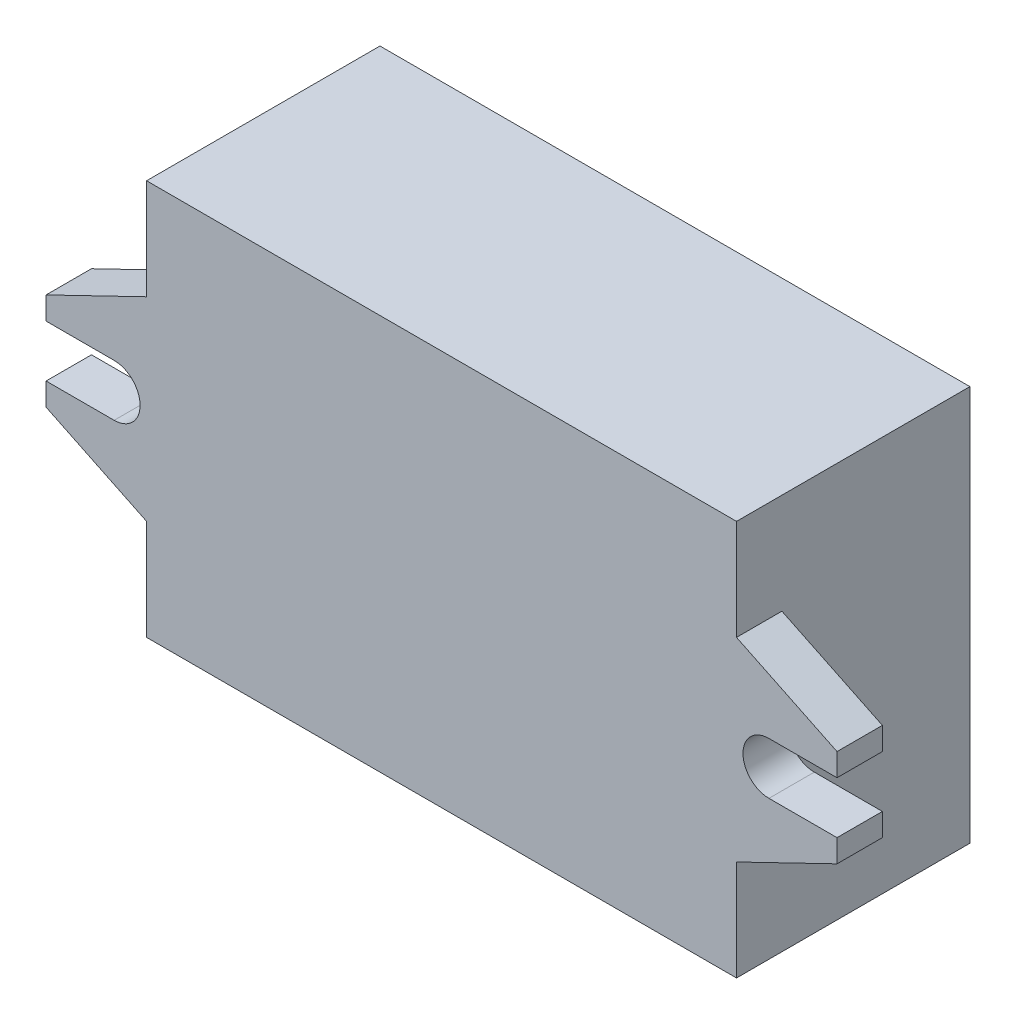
from build123d import *

# Parameters (mm, degrees)
SKETCH1_W           = 46.228
SKETCH1_H           = 30.988
BOSS_EXTRUDE1_DEPTH = 18.288
BOSS_EXTRUDE2_DEPTH = 3.556


with BuildPart() as part:
    # Sketch1 → Boss-Extrude1 (new body)
    with BuildSketch(Plane.XY):
        with Locations((23.114, 15.494)):
            Rectangle(SKETCH1_W, SKETCH1_H)
    extrude(amount=BOSS_EXTRUDE1_DEPTH)

    # Sketch2 → Boss-Extrude2 (add)
    with BuildSketch(Plane.XY.offset(18.288)):
        with BuildLine():
            Line((46.228, 23.114), (54.102, 19.304))
            Line((54.102, 19.304), (54.102, 17.526))
            Line((54.102, 17.526), (48.768, 17.526))
            ThreePointArc((48.768, 17.526), (47.331159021, 16.930840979), (46.736, 15.494))
            ThreePointArc((46.736, 15.494), (47.331159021, 14.057159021), (48.768, 13.462))
            Line((48.768, 13.462), (54.102, 13.462))
            Line((54.102, 13.462), (54.102, 11.684))
            Line((54.102, 11.684), (46.228, 7.874))
            Line((46.228, 7.874), (46.228, 23.114))
        make_face()
        with BuildLine():
            Line((0, 23.114), (0, 7.874))
            Line((0, 7.874), (-7.874, 11.684))
            Line((-7.874, 11.684), (-7.874, 13.462))
            Line((-7.874, 13.462), (-2.54, 13.462))
            ThreePointArc((-2.54, 13.462), (-1.103159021, 14.057159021), (-0.508, 15.494))
            ThreePointArc((-0.508, 15.494), (-1.103159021, 16.930840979), (-2.54, 17.526))
            Line((-2.54, 17.526), (-7.874, 17.526))
            Line((-7.874, 17.526), (-7.874, 19.304))
            Line((-7.874, 19.304), (0, 23.114))
        make_face()
    extrude(amount=-BOSS_EXTRUDE2_DEPTH)


solid = part.part
